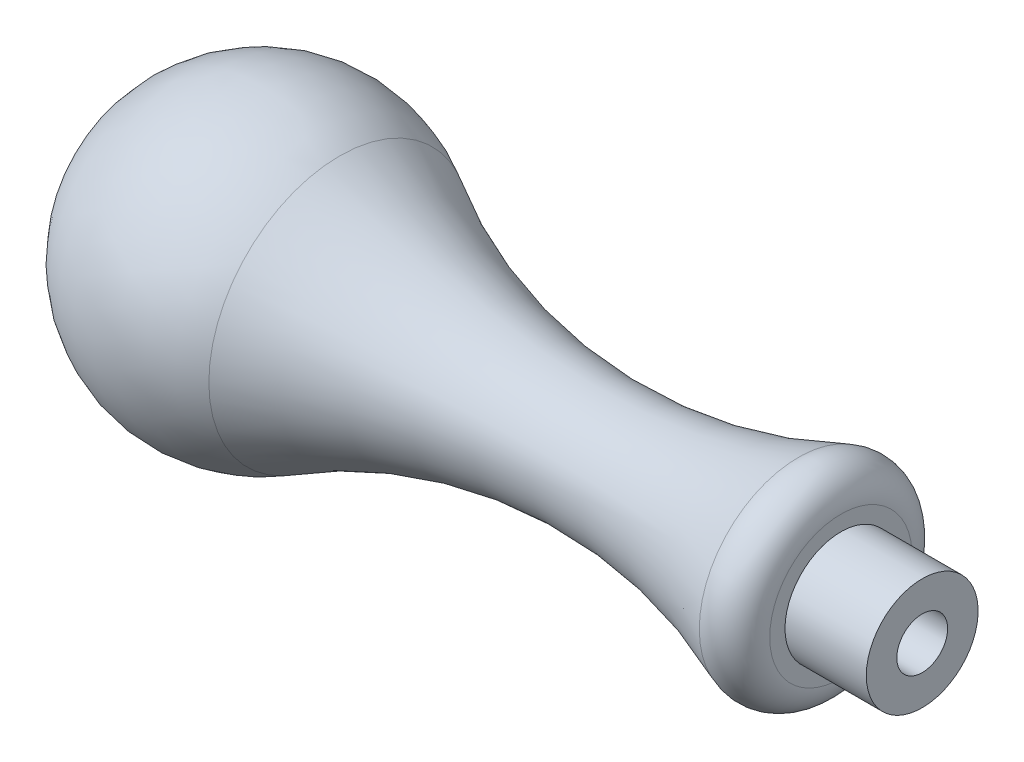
from build123d import *


with BuildPart() as part:
    # Sketch1 → Revolve1 (revolve)
    with BuildSketch(Plane.XY, mode=Mode.PRIVATE) as revolve1_sk:
        with BuildLine():
            Line((57, 7), (57, 5.5))
            Line((57, 5.5), (65, 5.5))
            Line((65, 5.5), (65, 2.5))
            Line((65, 2.5), (60, 2.5))
            Line((60, 2.5), (60, 0))
            Line((60, 0), (-15, 0))
            ThreePointArc((-15, 0), (-7.403493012, 13.045623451), (7.691772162, 12.877757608))
            ThreePointArc((7.691772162, 12.877757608), (29.888374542, 5.922274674), (52.830057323, 9.762468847))
            ThreePointArc((52.830057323, 9.762468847), (55.656830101, 9.50098261), (57, 7))
        make_face()
    revolve(revolve1_sk.sketch.rotate(Axis((-15, 0, 0), (1, 0, 0)), 90), axis=Axis((-15, 0, 0), (1, 0, 0)))


solid = part.part
